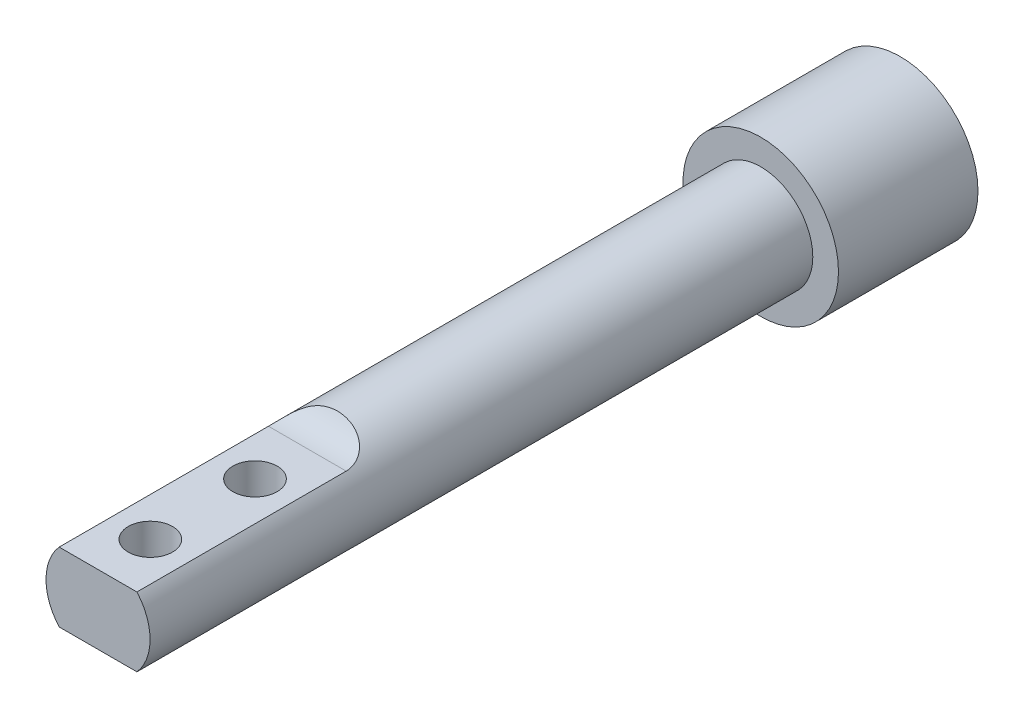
from build123d import *

# Parameters (mm, degrees)
SKETCH1_R               = 7.0739
EXTRUDE1_DEPTH          = 73.025
SKETCH2_R               = 7.0739
SKETCH2_R_2             = 4.7371
CUT_EXTRUDE1_DEPTH      = 60.325
CUT_EXTRUDE2_DEPTH      = 60.325
CUT_EXTRUDE2_DEPTH_BACK = 74.707060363
F_10_32_TAPPED_HOLE1_D  = 4.0386


with BuildPart() as part:
    # Sketch1 → Extrude1 (new body)
    with BuildSketch(Plane.XY):
        Circle(SKETCH1_R)
    extrude(amount=-EXTRUDE1_DEPTH)

    # Sketch2 → Cut-Extrude1 (cut)
    with BuildSketch(Plane.XY):
        Circle(SKETCH2_R)
        Circle(SKETCH2_R_2, mode=Mode.SUBTRACT)
    extrude(amount=-CUT_EXTRUDE1_DEPTH, mode=Mode.SUBTRACT)

    # Sketch4 → Cut-Extrude2 (cut, two sides: drawn at the far end of the back side and taken through both)
    with BuildSketch(Plane(origin=(0, 0, 0), x_dir=(0, 0, -1), z_dir=(1, 0, 0)).offset(-CUT_EXTRUDE2_DEPTH_BACK)):
        with BuildLine():
            Line((0, 3.1496), (19.05, 3.1496))
            ThreePointArc((19.05, 3.1496), (22.225, 6.3246), (19.05, 9.4996))
            Line((19.05, 9.4996), (0, 9.4996))
            Line((0, 9.4996), (0, 3.1496))
        make_face()
        with BuildLine():
            Line((19.05, -3.1496), (0, -3.1496))
            Line((0, -3.1496), (0, -9.4996))
            Line((0, -9.4996), (19.05, -9.4996))
            ThreePointArc((19.05, -9.4996), (22.225, -6.3246), (19.05, -3.1496))
        make_face()
    extrude(amount=CUT_EXTRUDE2_DEPTH + CUT_EXTRUDE2_DEPTH_BACK, mode=Mode.SUBTRACT)

    # 10-32 Tapped Hole1 (through all)
    with Locations(Plane(origin=(0, 3.1496, 0), x_dir=(-1, 0, 0), z_dir=(0, 1, 0))):
        with Locations((0, -4.7625), (0, -14.2875)):
            Hole(F_10_32_TAPPED_HOLE1_D / 2)


solid = part.part
